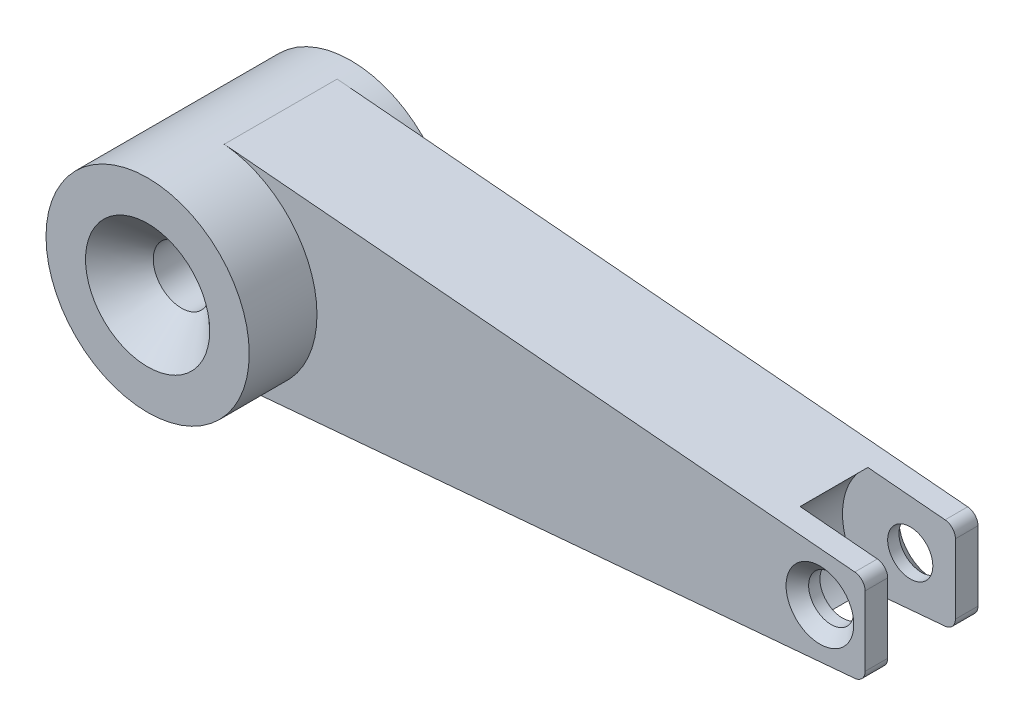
from build123d import *

# Parameters (mm, degrees)
IZIM1_R                     = 9
Y_KSEKLIK_EKSTR_ZYON1_DEPTH = 18
Y_KSEKLIK_EKSTR_ZYON2_DEPTH = 12
KES_EKSTR_ZYON1_DEPTH       = 2
IZIM5_R                     = 2.5
KES_EKSTR_ZYON2_DEPTH       = 29
KES_EKSTR_ZYON3_DEPTH       = 3
KES_EKSTR_ZYON3_DEPTH_BACK  = 3
IZIM6_R                     = 6
PAH1_SIZE                   = 3
RADYUS1_R                   = 1
IZIM7_R                     = 2
KES_EKSTR_ZYON4_DEPTH       = 13
PAH2_SIZE                   = 1


with BuildPart() as part:
    # izim1 → Y_kseklik-Ekstr_zyon1 (new body)
    with BuildSketch(Plane.XY):
        Circle(IZIM1_R)
    extrude(amount=Y_KSEKLIK_EKSTR_ZYON1_DEPTH)

    # izim2 → Y_kseklik-Ekstr_zyon2 (add)
    with BuildSketch(Plane.XY):
        Polygon((0.784401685, 8.965752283), (57.54321, 4), (57.54321, -4), (0.784401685, -8.965752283), align=None)
    extrude(amount=Y_KSEKLIK_EKSTR_ZYON2_DEPTH)

    # izim4 → Kes-Ekstr_zyon1 (cut)
    with BuildSketch(Plane(origin=(0, 0, 0), x_dir=(-1, 0, 0), z_dir=(0, 0, -1))):
        with BuildLine():
            Line((-0.784401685, 8.965752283), (-57.54321, 4))
            Line((-57.54321, 4), (-57.54321, -4))
            Line((-57.54321, -4), (-0.784401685, -8.965752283))
            ThreePointArc((-0.784401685, -8.965752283), (-9, 0), (-0.784401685, 8.965752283))
        make_face()
    extrude(amount=-KES_EKSTR_ZYON1_DEPTH, mode=Mode.SUBTRACT)

    # izim5 → Kes-Ekstr_zyon2 (cut)
    with BuildSketch(Plane(origin=(0, 0, 0), x_dir=(-1, 0, 0), z_dir=(0, 0, -1))):
        Circle(IZIM5_R)
    extrude(amount=-KES_EKSTR_ZYON2_DEPTH, mode=Mode.SUBTRACT)

    # izim6 → Kes-Ekstr_zyon3 (cut, two sides: drawn at the far end of the back side and taken through both)
    with BuildSketch(Plane.XY.offset(7).offset(-KES_EKSTR_ZYON3_DEPTH_BACK)):
        with Locations((53.54321, 0)):
            Circle(IZIM6_R)
    extrude(amount=KES_EKSTR_ZYON3_DEPTH + KES_EKSTR_ZYON3_DEPTH_BACK, mode=Mode.SUBTRACT)

    # Pah1
    pah1_edges = [part.edges().sort_by_distance(p)[0] for p in [
        (2.5, 0, 18),
        (2.5, 0, 0),
    ]]
    chamfer(pah1_edges, length=PAH1_SIZE)

    # Radyus1
    radyus1_edges = [part.edges().sort_by_distance(p)[0] for p in [
        (57.54321, 4, 3),
        (57.54321, -4, 3),
        (57.54321, -4, 11),
        (57.54321, 4, 11),
    ]]
    fillet(radyus1_edges, radius=RADYUS1_R)

    # izim7 → Kes-Ekstr_zyon4 (cut)
    with BuildSketch(Plane.XY.offset(12)):
        with Locations((53.54321, 0)):
            Circle(IZIM7_R)
    extrude(amount=-KES_EKSTR_ZYON4_DEPTH, mode=Mode.SUBTRACT)

    # Pah2
    pah2_edges = [part.edges().sort_by_distance(p)[0] for p in [
        (51.54321, 0, 2),
        (51.54321, 0, 12),
    ]]
    chamfer(pah2_edges, length=PAH2_SIZE)


solid = part.part
